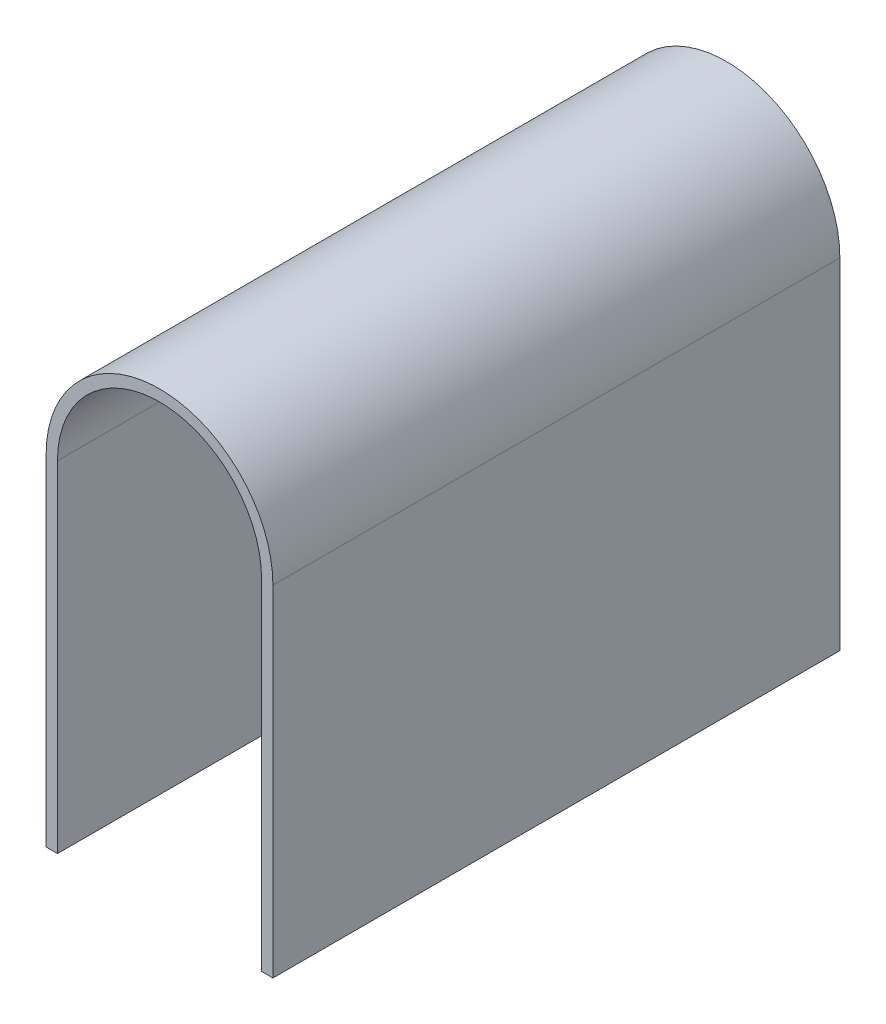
ISO-10303-21;
HEADER;
FILE_DESCRIPTION(('STEP AP214'),'2;1');
FILE_NAME('part.step','',(''),(''),'','','');
FILE_SCHEMA(('AUTOMOTIVE_DESIGN { 1 0 10303 214 1 1 1 1 }'));
ENDSEC;
DATA;
#1=APPLICATION_CONTEXT('core data for automotive mechanical design processes');
#2=APPLICATION_PROTOCOL_DEFINITION('international standard','automotive_design',2000,#1);
#3=PRODUCT_CONTEXT('',#1,'mechanical');
#4=PRODUCT('Part','Part','',(#3));
#5=PRODUCT_RELATED_PRODUCT_CATEGORY('part','',(#4));
#6=PRODUCT_DEFINITION_FORMATION('','',#4);
#7=PRODUCT_DEFINITION_CONTEXT('part definition',#1,'design');
#8=PRODUCT_DEFINITION('design','',#6,#7);
#9=PRODUCT_DEFINITION_SHAPE('','',#8);
#10=(LENGTH_UNIT() NAMED_UNIT(*) SI_UNIT(.MILLI.,.METRE.));
#11=(NAMED_UNIT(*) PLANE_ANGLE_UNIT() SI_UNIT($,.RADIAN.));
#12=(NAMED_UNIT(*) SI_UNIT($,.STERADIAN.) SOLID_ANGLE_UNIT());
#13=UNCERTAINTY_MEASURE_WITH_UNIT(LENGTH_MEASURE(1.E-05),#10,'distance_accuracy_value','');
#14=(GEOMETRIC_REPRESENTATION_CONTEXT(3) GLOBAL_UNCERTAINTY_ASSIGNED_CONTEXT((#13)) GLOBAL_UNIT_ASSIGNED_CONTEXT((#10,
#11,#12)) REPRESENTATION_CONTEXT('',''));
#15=CARTESIAN_POINT('',(0.,0.,0.));
#16=DIRECTION('',(0.,0.,1.));
#17=DIRECTION('',(1.,0.,0.));
#18=AXIS2_PLACEMENT_3D('',#15,#16,#17);
#19=CARTESIAN_POINT('',(0.,0.,500.));
#20=DIRECTION('',(0.,0.,-1.));
#21=DIRECTION('',(-1.,0.,0.));
#22=AXIS2_PLACEMENT_3D('',#19,#20,#21);
#23=CYLINDRICAL_SURFACE('',#22,100.);
#24=CARTESIAN_POINT('',(0.,0.,0.));
#25=DIRECTION('',(0.,0.,1.));
#26=DIRECTION('',(1.,0.,0.));
#27=AXIS2_PLACEMENT_3D('',#24,#25,#26);
#28=CIRCLE('',#27,100.);
#29=CARTESIAN_POINT('',(100.,0.,0.));
#30=VERTEX_POINT('',#29);
#31=CARTESIAN_POINT('',(-100.,0.,0.));
#32=VERTEX_POINT('',#31);
#33=EDGE_CURVE('E127',#30,#32,#28,.T.);
#34=ORIENTED_EDGE('',*,*,#33,.T.);
#35=DIRECTION('',(0.,0.,-1.));
#36=VECTOR('',#35,1.);
#37=CARTESIAN_POINT('',(-100.,0.,500.));
#38=LINE('',#37,#36);
#39=CARTESIAN_POINT('',(-100.,0.,500.));
#40=VERTEX_POINT('',#39);
#41=EDGE_CURVE('E11',#40,#32,#38,.T.);
#42=ORIENTED_EDGE('',*,*,#41,.F.);
#43=CARTESIAN_POINT('',(0.,0.,500.));
#44=DIRECTION('',(0.,0.,1.));
#45=DIRECTION('',(1.,0.,0.));
#46=AXIS2_PLACEMENT_3D('',#43,#44,#45);
#47=CIRCLE('',#46,100.);
#48=CARTESIAN_POINT('',(100.,0.,500.));
#49=VERTEX_POINT('',#48);
#50=EDGE_CURVE('E141',#49,#40,#47,.T.);
#51=ORIENTED_EDGE('',*,*,#50,.F.);
#52=DIRECTION('',(0.,0.,-1.));
#53=VECTOR('',#52,1.);
#54=CARTESIAN_POINT('',(100.,0.,500.));
#55=LINE('',#54,#53);
#56=EDGE_CURVE('E123',#49,#30,#55,.T.);
#57=ORIENTED_EDGE('',*,*,#56,.T.);
#58=EDGE_LOOP('',(#34,#42,#51,#57));
#59=FACE_BOUND('',#58,.T.);
#60=ADVANCED_FACE('F31',(#59),#23,.T.);
#61=CARTESIAN_POINT('',(-100.,0.,500.));
#62=DIRECTION('',(1.,0.,0.));
#63=DIRECTION('',(0.,1.,0.));
#64=AXIS2_PLACEMENT_3D('',#61,#62,#63);
#65=PLANE('',#64);
#66=DIRECTION('',(0.,-1.,0.));
#67=VECTOR('',#66,1.);
#68=CARTESIAN_POINT('',(-100.,0.,0.));
#69=LINE('',#68,#67);
#70=CARTESIAN_POINT('',(-99.9999999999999,-300.,0.));
#71=VERTEX_POINT('',#70);
#72=EDGE_CURVE('E130',#32,#71,#69,.T.);
#73=ORIENTED_EDGE('',*,*,#72,.T.);
#74=DIRECTION('',(0.,0.,-1.));
#75=VECTOR('',#74,1.);
#76=CARTESIAN_POINT('',(-99.9999999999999,-300.,500.));
#77=LINE('',#76,#75);
#78=CARTESIAN_POINT('',(-99.9999999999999,-300.,500.));
#79=VERTEX_POINT('',#78);
#80=EDGE_CURVE('E39',#79,#71,#77,.T.);
#81=ORIENTED_EDGE('',*,*,#80,.F.);
#82=DIRECTION('',(0.,-1.,0.));
#83=VECTOR('',#82,1.);
#84=CARTESIAN_POINT('',(-100.,0.,500.));
#85=LINE('',#84,#83);
#86=EDGE_CURVE('E90',#40,#79,#85,.T.);
#87=ORIENTED_EDGE('',*,*,#86,.F.);
#88=ORIENTED_EDGE('',*,*,#41,.T.);
#89=EDGE_LOOP('',(#73,#81,#87,#88));
#90=FACE_BOUND('',#89,.T.);
#91=ADVANCED_FACE('F176',(#90),#65,.F.);
#92=CARTESIAN_POINT('',(-99.9999999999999,-300.,500.));
#93=DIRECTION('',(0.,1.,0.));
#94=DIRECTION('',(0.,0.,1.));
#95=AXIS2_PLACEMENT_3D('',#92,#93,#94);
#96=PLANE('',#95);
#97=DIRECTION('',(1.,0.,0.));
#98=VECTOR('',#97,1.);
#99=CARTESIAN_POINT('',(-99.9999999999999,-300.,0.));
#100=LINE('',#99,#98);
#101=CARTESIAN_POINT('',(-90.,-300.,0.));
#102=VERTEX_POINT('',#101);
#103=EDGE_CURVE('E132',#71,#102,#100,.T.);
#104=ORIENTED_EDGE('',*,*,#103,.T.);
#105=DIRECTION('',(0.,0.,-1.));
#106=VECTOR('',#105,1.);
#107=CARTESIAN_POINT('',(-90.,-300.,500.));
#108=LINE('',#107,#106);
#109=CARTESIAN_POINT('',(-90.,-300.,500.));
#110=VERTEX_POINT('',#109);
#111=EDGE_CURVE('E148',#110,#102,#108,.T.);
#112=ORIENTED_EDGE('',*,*,#111,.F.);
#113=DIRECTION('',(1.,0.,0.));
#114=VECTOR('',#113,1.);
#115=CARTESIAN_POINT('',(-99.9999999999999,-300.,500.));
#116=LINE('',#115,#114);
#117=EDGE_CURVE('E156',#79,#110,#116,.T.);
#118=ORIENTED_EDGE('',*,*,#117,.F.);
#119=ORIENTED_EDGE('',*,*,#80,.T.);
#120=EDGE_LOOP('',(#104,#112,#118,#119));
#121=FACE_BOUND('',#120,.T.);
#122=ADVANCED_FACE('F154',(#121),#96,.F.);
#123=CARTESIAN_POINT('',(-90.,0.,500.));
#124=DIRECTION('',(-1.,0.,0.));
#125=DIRECTION('',(0.,-1.,0.));
#126=AXIS2_PLACEMENT_3D('',#123,#124,#125);
#127=PLANE('',#126);
#128=DIRECTION('',(0.,1.,0.));
#129=VECTOR('',#128,1.);
#130=CARTESIAN_POINT('',(-90.,0.,0.));
#131=LINE('',#130,#129);
#132=CARTESIAN_POINT('',(-90.,0.,0.));
#133=VERTEX_POINT('',#132);
#134=EDGE_CURVE('E134',#102,#133,#131,.T.);
#135=ORIENTED_EDGE('',*,*,#134,.T.);
#136=DIRECTION('',(0.,0.,-1.));
#137=VECTOR('',#136,1.);
#138=CARTESIAN_POINT('',(-90.,0.,500.));
#139=LINE('',#138,#137);
#140=CARTESIAN_POINT('',(-90.,0.,500.));
#141=VERTEX_POINT('',#140);
#142=EDGE_CURVE('E145',#141,#133,#139,.T.);
#143=ORIENTED_EDGE('',*,*,#142,.F.);
#144=DIRECTION('',(0.,1.,0.));
#145=VECTOR('',#144,1.);
#146=CARTESIAN_POINT('',(-90.,0.,500.));
#147=LINE('',#146,#145);
#148=EDGE_CURVE('E168',#110,#141,#147,.T.);
#149=ORIENTED_EDGE('',*,*,#148,.F.);
#150=ORIENTED_EDGE('',*,*,#111,.T.);
#151=EDGE_LOOP('',(#135,#143,#149,#150));
#152=FACE_BOUND('',#151,.T.);
#153=ADVANCED_FACE('F164',(#152),#127,.F.);
#154=CARTESIAN_POINT('',(0.,0.,500.));
#155=DIRECTION('',(0.,0.,-1.));
#156=DIRECTION('',(-1.,0.,0.));
#157=AXIS2_PLACEMENT_3D('',#154,#155,#156);
#158=CYLINDRICAL_SURFACE('',#157,90.);
#159=CARTESIAN_POINT('',(0.,0.,0.));
#160=DIRECTION('',(0.,0.,-1.));
#161=DIRECTION('',(1.,0.,0.));
#162=AXIS2_PLACEMENT_3D('',#159,#160,#161);
#163=CIRCLE('',#162,90.);
#164=CARTESIAN_POINT('',(90.,0.,0.));
#165=VERTEX_POINT('',#164);
#166=EDGE_CURVE('E136',#133,#165,#163,.T.);
#167=ORIENTED_EDGE('',*,*,#166,.T.);
#168=DIRECTION('',(0.,0.,-1.));
#169=VECTOR('',#168,1.);
#170=CARTESIAN_POINT('',(90.,0.,500.));
#171=LINE('',#170,#169);
#172=CARTESIAN_POINT('',(90.,0.,500.));
#173=VERTEX_POINT('',#172);
#174=EDGE_CURVE('E118',#173,#165,#171,.T.);
#175=ORIENTED_EDGE('',*,*,#174,.F.);
#176=CARTESIAN_POINT('',(0.,0.,500.));
#177=DIRECTION('',(0.,0.,-1.));
#178=DIRECTION('',(1.,0.,0.));
#179=AXIS2_PLACEMENT_3D('',#176,#177,#178);
#180=CIRCLE('',#179,90.);
#181=EDGE_CURVE('E109',#141,#173,#180,.T.);
#182=ORIENTED_EDGE('',*,*,#181,.F.);
#183=ORIENTED_EDGE('',*,*,#142,.T.);
#184=EDGE_LOOP('',(#167,#175,#182,#183));
#185=FACE_BOUND('',#184,.T.);
#186=ADVANCED_FACE('F167',(#185),#158,.F.);
#187=CARTESIAN_POINT('',(90.,0.,500.));
#188=DIRECTION('',(1.,0.,0.));
#189=DIRECTION('',(0.,1.,0.));
#190=AXIS2_PLACEMENT_3D('',#187,#188,#189);
#191=PLANE('',#190);
#192=DIRECTION('',(0.,-1.,0.));
#193=VECTOR('',#192,1.);
#194=CARTESIAN_POINT('',(90.,0.,0.));
#195=LINE('',#194,#193);
#196=CARTESIAN_POINT('',(90.,-300.,0.));
#197=VERTEX_POINT('',#196);
#198=EDGE_CURVE('E117',#165,#197,#195,.T.);
#199=ORIENTED_EDGE('',*,*,#198,.T.);
#200=DIRECTION('',(0.,0.,-1.));
#201=VECTOR('',#200,1.);
#202=CARTESIAN_POINT('',(90.,-300.,500.));
#203=LINE('',#202,#201);
#204=CARTESIAN_POINT('',(90.,-300.,500.));
#205=VERTEX_POINT('',#204);
#206=EDGE_CURVE('E114',#205,#197,#203,.T.);
#207=ORIENTED_EDGE('',*,*,#206,.F.);
#208=DIRECTION('',(0.,-1.,0.));
#209=VECTOR('',#208,1.);
#210=CARTESIAN_POINT('',(90.,0.,500.));
#211=LINE('',#210,#209);
#212=EDGE_CURVE('E103',#173,#205,#211,.T.);
#213=ORIENTED_EDGE('',*,*,#212,.F.);
#214=ORIENTED_EDGE('',*,*,#174,.T.);
#215=EDGE_LOOP('',(#199,#207,#213,#214));
#216=FACE_BOUND('',#215,.T.);
#217=ADVANCED_FACE('F115',(#216),#191,.F.);
#218=CARTESIAN_POINT('',(90.,-300.,500.));
#219=DIRECTION('',(0.,1.,0.));
#220=DIRECTION('',(0.,0.,1.));
#221=AXIS2_PLACEMENT_3D('',#218,#219,#220);
#222=PLANE('',#221);
#223=DIRECTION('',(1.,0.,0.));
#224=VECTOR('',#223,1.);
#225=CARTESIAN_POINT('',(90.,-300.,0.));
#226=LINE('',#225,#224);
#227=CARTESIAN_POINT('',(100.,-300.,0.));
#228=VERTEX_POINT('',#227);
#229=EDGE_CURVE('E76',#197,#228,#226,.T.);
#230=ORIENTED_EDGE('',*,*,#229,.T.);
#231=DIRECTION('',(0.,0.,-1.));
#232=VECTOR('',#231,1.);
#233=CARTESIAN_POINT('',(100.,-300.,500.));
#234=LINE('',#233,#232);
#235=CARTESIAN_POINT('',(100.,-300.,500.));
#236=VERTEX_POINT('',#235);
#237=EDGE_CURVE('E119',#236,#228,#234,.T.);
#238=ORIENTED_EDGE('',*,*,#237,.F.);
#239=DIRECTION('',(1.,0.,0.));
#240=VECTOR('',#239,1.);
#241=CARTESIAN_POINT('',(90.,-300.,500.));
#242=LINE('',#241,#240);
#243=EDGE_CURVE('E107',#205,#236,#242,.T.);
#244=ORIENTED_EDGE('',*,*,#243,.F.);
#245=ORIENTED_EDGE('',*,*,#206,.T.);
#246=EDGE_LOOP('',(#230,#238,#244,#245));
#247=FACE_BOUND('',#246,.T.);
#248=ADVANCED_FACE('F121',(#247),#222,.F.);
#249=CARTESIAN_POINT('',(100.,0.,500.));
#250=DIRECTION('',(-1.,0.,0.));
#251=DIRECTION('',(0.,-1.,0.));
#252=AXIS2_PLACEMENT_3D('',#249,#250,#251);
#253=PLANE('',#252);
#254=DIRECTION('',(0.,1.,0.));
#255=VECTOR('',#254,1.);
#256=CARTESIAN_POINT('',(100.,0.,0.));
#257=LINE('',#256,#255);
#258=EDGE_CURVE('E82',#228,#30,#257,.T.);
#259=ORIENTED_EDGE('',*,*,#258,.T.);
#260=ORIENTED_EDGE('',*,*,#56,.F.);
#261=DIRECTION('',(0.,1.,0.));
#262=VECTOR('',#261,1.);
#263=CARTESIAN_POINT('',(100.,0.,500.));
#264=LINE('',#263,#262);
#265=EDGE_CURVE('E47',#236,#49,#264,.T.);
#266=ORIENTED_EDGE('',*,*,#265,.F.);
#267=ORIENTED_EDGE('',*,*,#237,.T.);
#268=EDGE_LOOP('',(#259,#260,#266,#267));
#269=FACE_BOUND('',#268,.T.);
#270=ADVANCED_FACE('F192',(#269),#253,.F.);
#271=CARTESIAN_POINT('',(0.,0.,500.));
#272=DIRECTION('',(0.,0.,1.));
#273=DIRECTION('',(1.,0.,0.));
#274=AXIS2_PLACEMENT_3D('',#271,#272,#273);
#275=PLANE('',#274);
#276=ORIENTED_EDGE('',*,*,#50,.T.);
#277=ORIENTED_EDGE('',*,*,#86,.T.);
#278=ORIENTED_EDGE('',*,*,#117,.T.);
#279=ORIENTED_EDGE('',*,*,#148,.T.);
#280=ORIENTED_EDGE('',*,*,#181,.T.);
#281=ORIENTED_EDGE('',*,*,#212,.T.);
#282=ORIENTED_EDGE('',*,*,#243,.T.);
#283=ORIENTED_EDGE('',*,*,#265,.T.);
#284=EDGE_LOOP('',(#276,#277,#278,#279,#280,#281,#282,#283));
#285=FACE_BOUND('',#284,.T.);
#286=ADVANCED_FACE('F105',(#285),#275,.T.);
#287=CARTESIAN_POINT('',(0.,0.,0.));
#288=DIRECTION('',(0.,0.,1.));
#289=DIRECTION('',(1.,0.,0.));
#290=AXIS2_PLACEMENT_3D('',#287,#288,#289);
#291=PLANE('',#290);
#292=ORIENTED_EDGE('',*,*,#33,.F.);
#293=ORIENTED_EDGE('',*,*,#258,.F.);
#294=ORIENTED_EDGE('',*,*,#229,.F.);
#295=ORIENTED_EDGE('',*,*,#198,.F.);
#296=ORIENTED_EDGE('',*,*,#166,.F.);
#297=ORIENTED_EDGE('',*,*,#134,.F.);
#298=ORIENTED_EDGE('',*,*,#103,.F.);
#299=ORIENTED_EDGE('',*,*,#72,.F.);
#300=EDGE_LOOP('',(#292,#293,#294,#295,#296,#297,#298,#299));
#301=FACE_BOUND('',#300,.T.);
#302=ADVANCED_FACE('F160',(#301),#291,.F.);
#303=CLOSED_SHELL('',(#60,#91,#122,#153,#186,#217,#248,#270,#286,#302));
#304=MANIFOLD_SOLID_BREP('B2',#303);
#305=ADVANCED_BREP_SHAPE_REPRESENTATION('',(#18,#304),#14);
#306=SHAPE_DEFINITION_REPRESENTATION(#9,#305);
ENDSEC;
END-ISO-10303-21;
